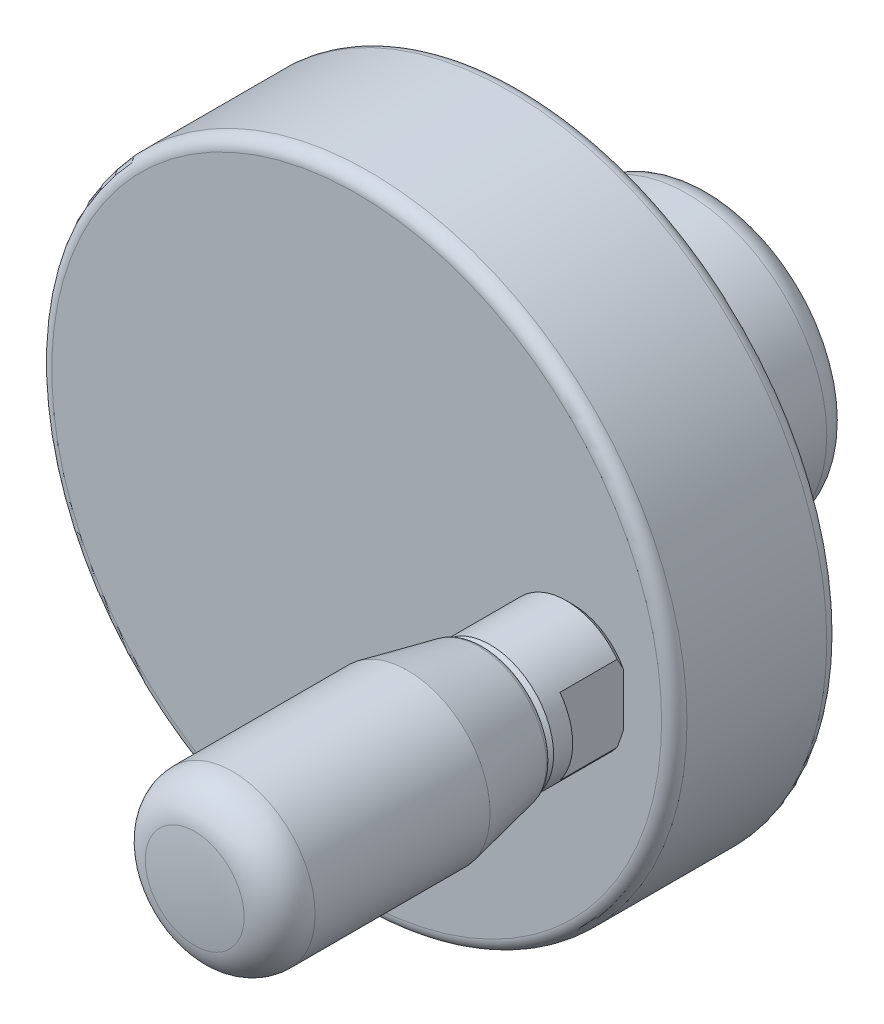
ISO-10303-21;
HEADER;
FILE_DESCRIPTION(('STEP AP214'),'2;1');
FILE_NAME('part.step','',(''),(''),'','','');
FILE_SCHEMA(('AUTOMOTIVE_DESIGN { 1 0 10303 214 1 1 1 1 }'));
ENDSEC;
DATA;
#1=APPLICATION_CONTEXT('core data for automotive mechanical design processes');
#2=APPLICATION_PROTOCOL_DEFINITION('international standard','automotive_design',2000,#1);
#3=PRODUCT_CONTEXT('',#1,'mechanical');
#4=PRODUCT('Part','Part','',(#3));
#5=PRODUCT_RELATED_PRODUCT_CATEGORY('part','',(#4));
#6=PRODUCT_DEFINITION_FORMATION('','',#4);
#7=PRODUCT_DEFINITION_CONTEXT('part definition',#1,'design');
#8=PRODUCT_DEFINITION('design','',#6,#7);
#9=PRODUCT_DEFINITION_SHAPE('','',#8);
#10=(LENGTH_UNIT() NAMED_UNIT(*) SI_UNIT(.MILLI.,.METRE.));
#11=(NAMED_UNIT(*) PLANE_ANGLE_UNIT() SI_UNIT($,.RADIAN.));
#12=(NAMED_UNIT(*) SI_UNIT($,.STERADIAN.) SOLID_ANGLE_UNIT());
#13=UNCERTAINTY_MEASURE_WITH_UNIT(LENGTH_MEASURE(1.E-05),#10,'distance_accuracy_value','');
#14=(GEOMETRIC_REPRESENTATION_CONTEXT(3) GLOBAL_UNCERTAINTY_ASSIGNED_CONTEXT((#13)) GLOBAL_UNIT_ASSIGNED_CONTEXT((#10,
#11,#12)) REPRESENTATION_CONTEXT('',''));
#15=CARTESIAN_POINT('',(0.,0.,0.));
#16=DIRECTION('',(0.,0.,1.));
#17=DIRECTION('',(1.,0.,0.));
#18=AXIS2_PLACEMENT_3D('',#15,#16,#17);
#19=CARTESIAN_POINT('',(0.,5.,18.));
#20=DIRECTION('',(0.,0.,1.));
#21=DIRECTION('',(1.,0.,0.));
#22=AXIS2_PLACEMENT_3D('',#19,#20,#21);
#23=PLANE('',#22);
#24=CARTESIAN_POINT('',(0.,0.,18.));
#25=DIRECTION('',(0.,0.,1.));
#26=DIRECTION('',(1.,0.,0.));
#27=AXIS2_PLACEMENT_3D('',#24,#25,#26);
#28=CIRCLE('',#27,5.);
#29=CARTESIAN_POINT('',(5.,0.,18.));
#30=VERTEX_POINT('',#29);
#31=EDGE_CURVE('E79',#30,#30,#28,.T.);
#32=ORIENTED_EDGE('',*,*,#31,.F.);
#33=EDGE_LOOP('',(#32));
#34=FACE_BOUND('',#33,.T.);
#35=ADVANCED_FACE('F14',(#34),#23,.F.);
#36=CARTESIAN_POINT('',(0.,0.,33.));
#37=DIRECTION('',(0.,0.,1.));
#38=DIRECTION('',(1.,0.,0.));
#39=AXIS2_PLACEMENT_3D('',#36,#37,#38);
#40=CYLINDRICAL_SURFACE('',#39,5.);
#41=CARTESIAN_POINT('',(0.,0.,0.));
#42=DIRECTION('',(0.,0.,1.));
#43=DIRECTION('',(1.,0.,0.));
#44=AXIS2_PLACEMENT_3D('',#41,#42,#43);
#45=CIRCLE('',#44,5.);
#46=CARTESIAN_POINT('',(5.,0.,0.));
#47=VERTEX_POINT('',#46);
#48=EDGE_CURVE('E182',#47,#47,#45,.T.);
#49=ORIENTED_EDGE('',*,*,#48,.F.);
#50=EDGE_LOOP('',(#49));
#51=FACE_BOUND('',#50,.T.);
#52=ORIENTED_EDGE('',*,*,#31,.T.);
#53=EDGE_LOOP('',(#52));
#54=FACE_BOUND('',#53,.T.);
#55=ADVANCED_FACE('F214',(#51,#54),#40,.F.);
#56=CARTESIAN_POINT('',(0.,9.,0.));
#57=DIRECTION('',(0.,0.,1.));
#58=DIRECTION('',(1.,0.,0.));
#59=AXIS2_PLACEMENT_3D('',#56,#57,#58);
#60=PLANE('',#59);
#61=CARTESIAN_POINT('',(0.,0.,0.));
#62=DIRECTION('',(0.,0.,1.));
#63=DIRECTION('',(1.,0.,0.));
#64=AXIS2_PLACEMENT_3D('',#61,#62,#63);
#65=CIRCLE('',#64,9.);
#66=CARTESIAN_POINT('',(9.,0.,0.));
#67=VERTEX_POINT('',#66);
#68=EDGE_CURVE('E179',#67,#67,#65,.T.);
#69=ORIENTED_EDGE('',*,*,#68,.F.);
#70=EDGE_LOOP('',(#69));
#71=FACE_BOUND('',#70,.T.);
#72=ORIENTED_EDGE('',*,*,#48,.T.);
#73=EDGE_LOOP('',(#72));
#74=FACE_BOUND('',#73,.T.);
#75=ADVANCED_FACE('F220',(#71,#74),#60,.F.);
#76=CARTESIAN_POINT('',(0.,0.,2.));
#77=DIRECTION('',(0.,0.,1.));
#78=DIRECTION('',(1.,0.,0.));
#79=AXIS2_PLACEMENT_3D('',#76,#77,#78);
#80=TOROIDAL_SURFACE('',#79,9.,2.);
#81=CARTESIAN_POINT('',(0.,0.,2.));
#82=DIRECTION('',(0.,0.,1.));
#83=DIRECTION('',(1.,0.,0.));
#84=AXIS2_PLACEMENT_3D('',#81,#82,#83);
#85=CIRCLE('',#84,11.);
#86=CARTESIAN_POINT('',(11.,0.,2.));
#87=VERTEX_POINT('',#86);
#88=EDGE_CURVE('E176',#87,#87,#85,.T.);
#89=ORIENTED_EDGE('',*,*,#88,.F.);
#90=EDGE_LOOP('',(#89));
#91=FACE_BOUND('',#90,.T.);
#92=ORIENTED_EDGE('',*,*,#68,.T.);
#93=EDGE_LOOP('',(#92));
#94=FACE_BOUND('',#93,.T.);
#95=ADVANCED_FACE('F228',(#91,#94),#80,.T.);
#96=CARTESIAN_POINT('',(0.,0.,33.));
#97=DIRECTION('',(0.,0.,1.));
#98=DIRECTION('',(1.,0.,0.));
#99=AXIS2_PLACEMENT_3D('',#96,#97,#98);
#100=CYLINDRICAL_SURFACE('',#99,11.);
#101=CARTESIAN_POINT('',(0.,0.,12.));
#102=DIRECTION('',(0.,0.,1.));
#103=DIRECTION('',(1.,0.,0.));
#104=AXIS2_PLACEMENT_3D('',#101,#102,#103);
#105=CIRCLE('',#104,11.);
#106=CARTESIAN_POINT('',(11.,0.,12.));
#107=VERTEX_POINT('',#106);
#108=EDGE_CURVE('E173',#107,#107,#105,.T.);
#109=ORIENTED_EDGE('',*,*,#108,.F.);
#110=EDGE_LOOP('',(#109));
#111=FACE_BOUND('',#110,.T.);
#112=ORIENTED_EDGE('',*,*,#88,.T.);
#113=EDGE_LOOP('',(#112));
#114=FACE_BOUND('',#113,.T.);
#115=ADVANCED_FACE('F235',(#111,#114),#100,.T.);
#116=CARTESIAN_POINT('',(0.,0.,12.));
#117=DIRECTION('',(0.,0.,1.));
#118=DIRECTION('',(1.,0.,0.));
#119=AXIS2_PLACEMENT_3D('',#116,#117,#118);
#120=TOROIDAL_SURFACE('',#119,14.,3.);
#121=CARTESIAN_POINT('',(0.,0.,15.));
#122=DIRECTION('',(0.,0.,1.));
#123=DIRECTION('',(1.,0.,0.));
#124=AXIS2_PLACEMENT_3D('',#121,#122,#123);
#125=CIRCLE('',#124,14.);
#126=CARTESIAN_POINT('',(14.,0.,15.));
#127=VERTEX_POINT('',#126);
#128=EDGE_CURVE('E170',#127,#127,#125,.T.);
#129=ORIENTED_EDGE('',*,*,#128,.F.);
#130=EDGE_LOOP('',(#129));
#131=FACE_BOUND('',#130,.T.);
#132=ORIENTED_EDGE('',*,*,#108,.T.);
#133=EDGE_LOOP('',(#132));
#134=FACE_BOUND('',#133,.T.);
#135=ADVANCED_FACE('F239',(#131,#134),#120,.F.);
#136=CARTESIAN_POINT('',(0.,24.,15.));
#137=DIRECTION('',(0.,0.,1.));
#138=DIRECTION('',(1.,0.,0.));
#139=AXIS2_PLACEMENT_3D('',#136,#137,#138);
#140=PLANE('',#139);
#141=CARTESIAN_POINT('',(0.,0.,15.));
#142=DIRECTION('',(0.,0.,1.));
#143=DIRECTION('',(1.,0.,0.));
#144=AXIS2_PLACEMENT_3D('',#141,#142,#143);
#145=CIRCLE('',#144,24.);
#146=CARTESIAN_POINT('',(24.,0.,15.));
#147=VERTEX_POINT('',#146);
#148=EDGE_CURVE('E167',#147,#147,#145,.T.);
#149=ORIENTED_EDGE('',*,*,#148,.F.);
#150=EDGE_LOOP('',(#149));
#151=FACE_BOUND('',#150,.T.);
#152=ORIENTED_EDGE('',*,*,#128,.T.);
#153=EDGE_LOOP('',(#152));
#154=FACE_BOUND('',#153,.T.);
#155=ADVANCED_FACE('F243',(#151,#154),#140,.F.);
#156=CARTESIAN_POINT('',(0.,0.,16.));
#157=DIRECTION('',(0.,0.,1.));
#158=DIRECTION('',(1.,0.,0.));
#159=AXIS2_PLACEMENT_3D('',#156,#157,#158);
#160=TOROIDAL_SURFACE('',#159,24.,1.00000000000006);
#161=CARTESIAN_POINT('',(0.,0.,16.));
#162=DIRECTION('',(0.,0.,1.));
#163=DIRECTION('',(1.,0.,0.));
#164=AXIS2_PLACEMENT_3D('',#161,#162,#163);
#165=CIRCLE('',#164,25.);
#166=CARTESIAN_POINT('',(25.,0.,16.));
#167=VERTEX_POINT('',#166);
#168=EDGE_CURVE('E162',#167,#167,#165,.T.);
#169=ORIENTED_EDGE('',*,*,#168,.F.);
#170=EDGE_LOOP('',(#169));
#171=FACE_BOUND('',#170,.T.);
#172=ORIENTED_EDGE('',*,*,#148,.T.);
#173=EDGE_LOOP('',(#172));
#174=FACE_BOUND('',#173,.T.);
#175=ADVANCED_FACE('F247',(#171,#174),#160,.T.);
#176=CARTESIAN_POINT('',(0.,0.,33.));
#177=DIRECTION('',(0.,0.,1.));
#178=DIRECTION('',(1.,0.,0.));
#179=AXIS2_PLACEMENT_3D('',#176,#177,#178);
#180=CYLINDRICAL_SURFACE('',#179,25.);
#181=CARTESIAN_POINT('',(0.,0.,27.));
#182=DIRECTION('',(0.,0.,1.));
#183=DIRECTION('',(1.,0.,0.));
#184=AXIS2_PLACEMENT_3D('',#181,#182,#183);
#185=CIRCLE('',#184,25.);
#186=CARTESIAN_POINT('',(25.,0.,27.));
#187=VERTEX_POINT('',#186);
#188=EDGE_CURVE('E158',#187,#187,#185,.T.);
#189=ORIENTED_EDGE('',*,*,#188,.F.);
#190=EDGE_LOOP('',(#189));
#191=FACE_BOUND('',#190,.T.);
#192=ORIENTED_EDGE('',*,*,#168,.T.);
#193=EDGE_LOOP('',(#192));
#194=FACE_BOUND('',#193,.T.);
#195=ADVANCED_FACE('F251',(#191,#194),#180,.T.);
#196=CARTESIAN_POINT('',(0.,0.,27.));
#197=DIRECTION('',(0.,0.,1.));
#198=DIRECTION('',(1.,0.,0.));
#199=AXIS2_PLACEMENT_3D('',#196,#197,#198);
#200=TOROIDAL_SURFACE('',#199,24.,0.999999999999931);
#201=CARTESIAN_POINT('',(0.,0.,28.));
#202=DIRECTION('',(0.,0.,1.));
#203=DIRECTION('',(1.,0.,0.));
#204=AXIS2_PLACEMENT_3D('',#201,#202,#203);
#205=CIRCLE('',#204,24.);
#206=CARTESIAN_POINT('',(24.,0.,28.));
#207=VERTEX_POINT('',#206);
#208=EDGE_CURVE('E156',#207,#207,#205,.T.);
#209=ORIENTED_EDGE('',*,*,#208,.F.);
#210=EDGE_LOOP('',(#209));
#211=FACE_BOUND('',#210,.T.);
#212=ORIENTED_EDGE('',*,*,#188,.T.);
#213=EDGE_LOOP('',(#212));
#214=FACE_BOUND('',#213,.T.);
#215=ADVANCED_FACE('F255',(#211,#214),#200,.T.);
#216=CARTESIAN_POINT('',(0.,24.,28.));
#217=DIRECTION('',(0.,0.,-1.));
#218=DIRECTION('',(-1.,0.,0.));
#219=AXIS2_PLACEMENT_3D('',#216,#217,#218);
#220=PLANE('',#219);
#221=CARTESIAN_POINT('',(17.,0.,28.));
#222=DIRECTION('',(0.,0.,-1.));
#223=DIRECTION('',(0.,1.,0.));
#224=AXIS2_PLACEMENT_3D('',#221,#222,#223);
#225=CIRCLE('',#224,4.5);
#226=CARTESIAN_POINT('',(21.,2.06155281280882,28.));
#227=VERTEX_POINT('',#226);
#228=CARTESIAN_POINT('',(13.,2.06155281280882,28.));
#229=VERTEX_POINT('',#228);
#230=EDGE_CURVE('E24',#227,#229,#225,.F.);
#231=ORIENTED_EDGE('',*,*,#230,.F.);
#232=DIRECTION('',(0.,-1.,0.));
#233=VECTOR('',#232,1.);
#234=CARTESIAN_POINT('',(21.,24.,28.));
#235=LINE('',#234,#233);
#236=CARTESIAN_POINT('',(21.,-2.06155281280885,28.));
#237=VERTEX_POINT('',#236);
#238=EDGE_CURVE('E9',#227,#237,#235,.T.);
#239=ORIENTED_EDGE('',*,*,#238,.T.);
#240=CARTESIAN_POINT('',(17.,0.,28.));
#241=DIRECTION('',(0.,0.,-1.));
#242=DIRECTION('',(0.,1.,0.));
#243=AXIS2_PLACEMENT_3D('',#240,#241,#242);
#244=CIRCLE('',#243,4.5);
#245=CARTESIAN_POINT('',(13.,-2.06155281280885,28.));
#246=VERTEX_POINT('',#245);
#247=EDGE_CURVE('E71',#246,#237,#244,.F.);
#248=ORIENTED_EDGE('',*,*,#247,.F.);
#249=DIRECTION('',(0.,1.,0.));
#250=VECTOR('',#249,1.);
#251=CARTESIAN_POINT('',(13.,24.,28.));
#252=LINE('',#251,#250);
#253=EDGE_CURVE('E73',#246,#229,#252,.T.);
#254=ORIENTED_EDGE('',*,*,#253,.T.);
#255=EDGE_LOOP('',(#231,#239,#248,#254));
#256=FACE_BOUND('',#255,.T.);
#257=ORIENTED_EDGE('',*,*,#208,.T.);
#258=EDGE_LOOP('',(#257));
#259=FACE_BOUND('',#258,.T.);
#260=ADVANCED_FACE('F74',(#256,#259),#220,.F.);
#261=CARTESIAN_POINT('',(17.,0.,28.));
#262=DIRECTION('',(0.,0.,1.));
#263=DIRECTION('',(0.,1.,0.));
#264=AXIS2_PLACEMENT_3D('',#261,#262,#263);
#265=SPHERICAL_SURFACE('',#264,30.);
#266=CARTESIAN_POINT('',(17.,0.,57.7468745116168));
#267=DIRECTION('',(0.,0.,1.));
#268=DIRECTION('',(1.,0.,0.));
#269=AXIS2_PLACEMENT_3D('',#266,#267,#268);
#270=CIRCLE('',#269,3.88888888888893);
#271=CARTESIAN_POINT('',(20.8888888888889,0.,57.7468745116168));
#272=VERTEX_POINT('',#271);
#273=EDGE_CURVE('E129',#272,#272,#270,.T.);
#274=ORIENTED_EDGE('',*,*,#273,.T.);
#275=EDGE_LOOP('',(#274));
#276=FACE_BOUND('',#275,.T.);
#277=ADVANCED_FACE('F16',(#276),#265,.T.);
#278=CARTESIAN_POINT('',(17.,0.,54.7721870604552));
#279=DIRECTION('',(0.,0.,1.));
#280=DIRECTION('',(1.,0.,0.));
#281=AXIS2_PLACEMENT_3D('',#278,#279,#280);
#282=TOROIDAL_SURFACE('',#281,3.5,3.);
#283=ORIENTED_EDGE('',*,*,#273,.F.);
#284=EDGE_LOOP('',(#283));
#285=FACE_BOUND('',#284,.T.);
#286=CARTESIAN_POINT('',(17.,0.,54.7721870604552));
#287=DIRECTION('',(0.,0.,1.));
#288=DIRECTION('',(1.,0.,0.));
#289=AXIS2_PLACEMENT_3D('',#286,#287,#288);
#290=CIRCLE('',#289,6.5);
#291=CARTESIAN_POINT('',(23.5,0.,54.7721870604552));
#292=VERTEX_POINT('',#291);
#293=EDGE_CURVE('E132',#292,#292,#290,.T.);
#294=ORIENTED_EDGE('',*,*,#293,.T.);
#295=EDGE_LOOP('',(#294));
#296=FACE_BOUND('',#295,.T.);
#297=ADVANCED_FACE('F201',(#285,#296),#282,.T.);
#298=CARTESIAN_POINT('',(17.,0.,60.5));
#299=DIRECTION('',(0.,0.,1.));
#300=DIRECTION('',(1.,0.,0.));
#301=AXIS2_PLACEMENT_3D('',#298,#299,#300);
#302=CYLINDRICAL_SURFACE('',#301,6.5);
#303=ORIENTED_EDGE('',*,*,#293,.F.);
#304=EDGE_LOOP('',(#303));
#305=FACE_BOUND('',#304,.T.);
#306=CARTESIAN_POINT('',(17.,0.,41.));
#307=DIRECTION('',(0.,0.,1.));
#308=DIRECTION('',(1.,0.,0.));
#309=AXIS2_PLACEMENT_3D('',#306,#307,#308);
#310=CIRCLE('',#309,6.5);
#311=CARTESIAN_POINT('',(23.5,0.,41.));
#312=VERTEX_POINT('',#311);
#313=EDGE_CURVE('E135',#312,#312,#310,.T.);
#314=ORIENTED_EDGE('',*,*,#313,.T.);
#315=EDGE_LOOP('',(#314));
#316=FACE_BOUND('',#315,.T.);
#317=ADVANCED_FACE('F211',(#305,#316),#302,.T.);
#318=CARTESIAN_POINT('',(17.,0.,35.398022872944));
#319=DIRECTION('',(0.,0.,1.));
#320=DIRECTION('',(1.,0.,0.));
#321=AXIS2_PLACEMENT_3D('',#318,#319,#320);
#322=CONICAL_SURFACE('',#321,5.33292143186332,0.20539538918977);
#323=ORIENTED_EDGE('',*,*,#313,.F.);
#324=EDGE_LOOP('',(#323));
#325=FACE_BOUND('',#324,.T.);
#326=CARTESIAN_POINT('',(17.,0.,35.398022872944));
#327=DIRECTION('',(0.,0.,1.));
#328=DIRECTION('',(1.,0.,0.));
#329=AXIS2_PLACEMENT_3D('',#326,#327,#328);
#330=CIRCLE('',#329,5.33292143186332);
#331=CARTESIAN_POINT('',(22.3329214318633,0.,35.398022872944));
#332=VERTEX_POINT('',#331);
#333=EDGE_CURVE('E138',#332,#332,#330,.T.);
#334=ORIENTED_EDGE('',*,*,#333,.T.);
#335=EDGE_LOOP('',(#334));
#336=FACE_BOUND('',#335,.T.);
#337=ADVANCED_FACE('F283',(#325,#336),#322,.T.);
#338=CARTESIAN_POINT('',(17.,0.,35.5));
#339=DIRECTION('',(0.,0.,1.));
#340=DIRECTION('',(1.,0.,0.));
#341=AXIS2_PLACEMENT_3D('',#338,#339,#340);
#342=TOROIDAL_SURFACE('',#341,4.84343122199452,0.500000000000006);
#343=ORIENTED_EDGE('',*,*,#333,.F.);
#344=EDGE_LOOP('',(#343));
#345=FACE_BOUND('',#344,.T.);
#346=CARTESIAN_POINT('',(17.,0.,35.));
#347=DIRECTION('',(0.,0.,1.));
#348=DIRECTION('',(1.,0.,0.));
#349=AXIS2_PLACEMENT_3D('',#346,#347,#348);
#350=CIRCLE('',#349,4.84343122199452);
#351=CARTESIAN_POINT('',(21.8434312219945,0.,35.));
#352=VERTEX_POINT('',#351);
#353=EDGE_CURVE('E141',#352,#352,#350,.T.);
#354=ORIENTED_EDGE('',*,*,#353,.T.);
#355=EDGE_LOOP('',(#354));
#356=FACE_BOUND('',#355,.T.);
#357=ADVANCED_FACE('F279',(#345,#356),#342,.T.);
#358=CARTESIAN_POINT('',(17.,4.84343122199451,35.));
#359=DIRECTION('',(0.,0.,1.));
#360=DIRECTION('',(1.,0.,0.));
#361=AXIS2_PLACEMENT_3D('',#358,#359,#360);
#362=PLANE('',#361);
#363=ORIENTED_EDGE('',*,*,#353,.F.);
#364=EDGE_LOOP('',(#363));
#365=FACE_BOUND('',#364,.T.);
#366=CARTESIAN_POINT('',(17.,0.,35.));
#367=DIRECTION('',(0.,0.,1.));
#368=DIRECTION('',(1.,0.,0.));
#369=AXIS2_PLACEMENT_3D('',#366,#367,#368);
#370=CIRCLE('',#369,4.49999999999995);
#371=CARTESIAN_POINT('',(21.5,0.,35.));
#372=VERTEX_POINT('',#371);
#373=EDGE_CURVE('E144',#372,#372,#370,.T.);
#374=ORIENTED_EDGE('',*,*,#373,.T.);
#375=EDGE_LOOP('',(#374));
#376=FACE_BOUND('',#375,.T.);
#377=ADVANCED_FACE('F207',(#365,#376),#362,.F.);
#378=CARTESIAN_POINT('',(17.,0.,34.5));
#379=DIRECTION('',(0.,0.,-1.));
#380=DIRECTION('',(-1.,0.,0.));
#381=AXIS2_PLACEMENT_3D('',#378,#379,#380);
#382=CONICAL_SURFACE('',#381,5.,0.785398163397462);
#383=ORIENTED_EDGE('',*,*,#373,.F.);
#384=EDGE_LOOP('',(#383));
#385=FACE_BOUND('',#384,.T.);
#386=CARTESIAN_POINT('',(17.,0.,34.5));
#387=DIRECTION('',(0.,0.,1.));
#388=DIRECTION('',(1.,0.,0.));
#389=AXIS2_PLACEMENT_3D('',#386,#387,#388);
#390=CIRCLE('',#389,5.);
#391=CARTESIAN_POINT('',(22.,0.,34.5));
#392=VERTEX_POINT('',#391);
#393=EDGE_CURVE('E147',#392,#392,#390,.T.);
#394=ORIENTED_EDGE('',*,*,#393,.T.);
#395=EDGE_LOOP('',(#394));
#396=FACE_BOUND('',#395,.T.);
#397=ADVANCED_FACE('F200',(#385,#396),#382,.T.);
#398=CARTESIAN_POINT('',(21.,3.,33.));
#399=DIRECTION('',(0.,0.,1.));
#400=DIRECTION('',(1.,0.,0.));
#401=AXIS2_PLACEMENT_3D('',#398,#399,#400);
#402=PLANE('',#401);
#403=CARTESIAN_POINT('',(17.,0.,33.));
#404=DIRECTION('',(0.,0.,1.));
#405=DIRECTION('',(1.,0.,0.));
#406=AXIS2_PLACEMENT_3D('',#403,#404,#405);
#407=CIRCLE('',#406,5.);
#408=CARTESIAN_POINT('',(21.,-3.,33.));
#409=VERTEX_POINT('',#408);
#410=CARTESIAN_POINT('',(21.,3.,33.));
#411=VERTEX_POINT('',#410);
#412=EDGE_CURVE('E153',#409,#411,#407,.T.);
#413=ORIENTED_EDGE('',*,*,#412,.F.);
#414=DIRECTION('',(0.,-1.,0.));
#415=VECTOR('',#414,1.);
#416=CARTESIAN_POINT('',(21.,3.,33.));
#417=LINE('',#416,#415);
#418=EDGE_CURVE('E61',#411,#409,#417,.T.);
#419=ORIENTED_EDGE('',*,*,#418,.F.);
#420=EDGE_LOOP('',(#413,#419));
#421=FACE_BOUND('',#420,.T.);
#422=ADVANCED_FACE('F117',(#421),#402,.F.);
#423=CARTESIAN_POINT('',(13.,3.,33.));
#424=DIRECTION('',(0.,0.,-1.));
#425=DIRECTION('',(-1.,0.,0.));
#426=AXIS2_PLACEMENT_3D('',#423,#424,#425);
#427=PLANE('',#426);
#428=CARTESIAN_POINT('',(17.,0.,33.));
#429=DIRECTION('',(0.,0.,-1.));
#430=DIRECTION('',(-1.,0.,0.));
#431=AXIS2_PLACEMENT_3D('',#428,#429,#430);
#432=CIRCLE('',#431,5.);
#433=CARTESIAN_POINT('',(13.,-3.,33.));
#434=VERTEX_POINT('',#433);
#435=CARTESIAN_POINT('',(13.,2.99999999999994,33.));
#436=VERTEX_POINT('',#435);
#437=EDGE_CURVE('E67',#434,#436,#432,.T.);
#438=ORIENTED_EDGE('',*,*,#437,.T.);
#439=DIRECTION('',(0.,-1.,0.));
#440=VECTOR('',#439,1.);
#441=CARTESIAN_POINT('',(13.,3.,33.));
#442=LINE('',#441,#440);
#443=EDGE_CURVE('E187',#436,#434,#442,.T.);
#444=ORIENTED_EDGE('',*,*,#443,.T.);
#445=EDGE_LOOP('',(#438,#444));
#446=FACE_BOUND('',#445,.T.);
#447=ADVANCED_FACE('F112',(#446),#427,.T.);
#448=CARTESIAN_POINT('',(17.,0.,60.5));
#449=DIRECTION('',(0.,0.,1.));
#450=DIRECTION('',(1.,0.,0.));
#451=AXIS2_PLACEMENT_3D('',#448,#449,#450);
#452=CYLINDRICAL_SURFACE('',#451,5.);
#453=ORIENTED_EDGE('',*,*,#393,.F.);
#454=EDGE_LOOP('',(#453));
#455=FACE_BOUND('',#454,.T.);
#456=DIRECTION('',(0.,0.,1.));
#457=VECTOR('',#456,1.);
#458=CARTESIAN_POINT('',(13.,2.99999999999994,60.5));
#459=LINE('',#458,#457);
#460=CARTESIAN_POINT('',(13.,3.,28.5));
#461=VERTEX_POINT('',#460);
#462=EDGE_CURVE('E18',#436,#461,#459,.F.);
#463=ORIENTED_EDGE('',*,*,#462,.F.);
#464=ORIENTED_EDGE('',*,*,#437,.F.);
#465=DIRECTION('',(0.,0.,-1.));
#466=VECTOR('',#465,1.);
#467=CARTESIAN_POINT('',(13.,-3.,28.));
#468=LINE('',#467,#466);
#469=CARTESIAN_POINT('',(13.,-3.,28.5));
#470=VERTEX_POINT('',#469);
#471=EDGE_CURVE('E96',#434,#470,#468,.T.);
#472=ORIENTED_EDGE('',*,*,#471,.T.);
#473=CARTESIAN_POINT('',(17.,0.,28.5));
#474=DIRECTION('',(0.,0.,1.));
#475=DIRECTION('',(1.,0.,0.));
#476=AXIS2_PLACEMENT_3D('',#473,#474,#475);
#477=CIRCLE('',#476,5.);
#478=CARTESIAN_POINT('',(21.,-3.,28.5));
#479=VERTEX_POINT('',#478);
#480=EDGE_CURVE('E150',#470,#479,#477,.T.);
#481=ORIENTED_EDGE('',*,*,#480,.T.);
#482=DIRECTION('',(0.,0.,-1.));
#483=VECTOR('',#482,1.);
#484=CARTESIAN_POINT('',(21.,-3.,33.));
#485=LINE('',#484,#483);
#486=EDGE_CURVE('E94',#409,#479,#485,.T.);
#487=ORIENTED_EDGE('',*,*,#486,.F.);
#488=ORIENTED_EDGE('',*,*,#412,.T.);
#489=DIRECTION('',(0.,0.,1.));
#490=VECTOR('',#489,1.);
#491=CARTESIAN_POINT('',(21.,2.99999999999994,60.5));
#492=LINE('',#491,#490);
#493=CARTESIAN_POINT('',(21.,3.,28.5));
#494=VERTEX_POINT('',#493);
#495=EDGE_CURVE('E155',#494,#411,#492,.T.);
#496=ORIENTED_EDGE('',*,*,#495,.F.);
#497=EDGE_CURVE('E151',#494,#461,#477,.T.);
#498=ORIENTED_EDGE('',*,*,#497,.T.);
#499=EDGE_LOOP('',(#463,#464,#472,#481,#487,#488,#496,#498));
#500=FACE_BOUND('',#499,.T.);
#501=ADVANCED_FACE('F116',(#455,#500),#452,.T.);
#502=CARTESIAN_POINT('',(17.,0.,28.));
#503=DIRECTION('',(0.,0.,1.));
#504=DIRECTION('',(1.,0.,0.));
#505=AXIS2_PLACEMENT_3D('',#502,#503,#504);
#506=CONICAL_SURFACE('',#505,4.5,0.785398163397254);
#507=CARTESIAN_POINT('',(13.,6.61267837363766,31.2283578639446));
#508=CARTESIAN_POINT('',(13.,6.5138484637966,31.1437976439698));
#509=CARTESIAN_POINT('',(13.,6.41477027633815,31.0595275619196));
#510=CARTESIAN_POINT('',(13.,6.21605204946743,30.8916487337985));
#511=CARTESIAN_POINT('',(13.,6.11641199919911,30.8080400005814));
#512=CARTESIAN_POINT('',(13.,5.81645670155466,30.5582489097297));
#513=CARTESIAN_POINT('',(13.,5.61520522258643,30.3931865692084));
#514=CARTESIAN_POINT('',(13.,5.20414443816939,30.0626045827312));
#515=CARTESIAN_POINT('',(13.,4.99425007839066,29.8971902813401));
#516=CARTESIAN_POINT('',(13.,4.57024237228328,29.5719522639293));
#517=CARTESIAN_POINT('',(13.,4.35613010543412,29.4121271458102));
#518=CARTESIAN_POINT('',(13.,3.92191769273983,29.0998698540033));
#519=CARTESIAN_POINT('',(13.,3.70180729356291,28.9474517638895));
#520=CARTESIAN_POINT('',(13.,3.3660226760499,28.7271432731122));
#521=CARTESIAN_POINT('',(13.,3.25310127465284,28.655060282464));
#522=CARTESIAN_POINT('',(13.,3.02514651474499,28.514324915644));
#523=CARTESIAN_POINT('',(13.,2.91011332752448,28.4456722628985));
#524=CARTESIAN_POINT('',(13.,2.67874926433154,28.3131895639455));
#525=CARTESIAN_POINT('',(13.,2.56244159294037,28.2493194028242));
#526=CARTESIAN_POINT('',(13.,2.32719948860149,28.1266386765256));
#527=CARTESIAN_POINT('',(13.,2.2082647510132,28.0678287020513));
#528=CARTESIAN_POINT('',(13.,1.847452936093,27.9008663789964));
#529=CARTESIAN_POINT('',(13.,1.60104963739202,27.8018732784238));
#530=CARTESIAN_POINT('',(13.,1.21869368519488,27.6797214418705));
#531=CARTESIAN_POINT('',(13.,1.08703991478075,27.6430541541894));
#532=CARTESIAN_POINT('',(13.,0.820997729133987,27.5813368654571));
#533=CARTESIAN_POINT('',(13.,0.686609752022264,27.556285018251));
#534=CARTESIAN_POINT('',(13.,0.416637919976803,27.5194288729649));
#535=CARTESIAN_POINT('',(13.,0.281062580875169,27.5075632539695));
#536=CARTESIAN_POINT('',(13.,0.00940161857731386,27.4977080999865));
#537=CARTESIAN_POINT('',(13.,-0.126683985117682,27.4997180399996));
#538=CARTESIAN_POINT('',(13.,-0.397695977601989,27.5174494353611));
#539=CARTESIAN_POINT('',(13.,-0.532623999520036,27.5331464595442));
#540=CARTESIAN_POINT('',(13.,-0.80039046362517,27.5771511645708));
#541=CARTESIAN_POINT('',(13.,-0.933228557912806,27.6054609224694));
#542=CARTESIAN_POINT('',(13.,-1.19683850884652,27.6732578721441));
#543=CARTESIAN_POINT('',(13.,-1.32759286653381,27.712812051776));
#544=CARTESIAN_POINT('',(13.,-1.58587707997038,27.8011944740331));
#545=CARTESIAN_POINT('',(13.,-1.71340705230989,27.8500223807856));
#546=CARTESIAN_POINT('',(13.,-2.00607339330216,27.9722871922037));
#547=CARTESIAN_POINT('',(13.,-2.17001221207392,28.0485725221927));
#548=CARTESIAN_POINT('',(13.,-2.49288824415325,28.2111596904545));
#549=CARTESIAN_POINT('',(13.,-2.65182228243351,28.2974677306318));
#550=CARTESIAN_POINT('',(13.,-2.96566951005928,28.4778181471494));
#551=CARTESIAN_POINT('',(13.,-3.12057308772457,28.5718771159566));
#552=CARTESIAN_POINT('',(13.,-3.42666836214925,28.7657420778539));
#553=CARTESIAN_POINT('',(13.,-3.57786085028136,28.8655468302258));
#554=CARTESIAN_POINT('',(13.,-3.87789023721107,29.0700932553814));
#555=CARTESIAN_POINT('',(13.,-4.02671282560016,29.1748558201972));
#556=CARTESIAN_POINT('',(13.,-4.32180408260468,29.3879178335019));
#557=CARTESIAN_POINT('',(13.,-4.46807264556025,29.496217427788));
#558=CARTESIAN_POINT('',(13.,-4.75830471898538,29.7154998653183));
#559=CARTESIAN_POINT('',(13.,-4.90227076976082,29.8264793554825));
#560=CARTESIAN_POINT('',(13.,-5.18842229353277,30.050713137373));
#561=CARTESIAN_POINT('',(13.,-5.33060772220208,30.1639674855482));
#562=CARTESIAN_POINT('',(13.,-5.66527129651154,30.4341347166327));
#563=CARTESIAN_POINT('',(13.,-5.85710121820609,30.5918491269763));
#564=CARTESIAN_POINT('',(13.,-6.23712174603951,30.9088482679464));
#565=CARTESIAN_POINT('',(13.,-6.42532862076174,31.0681134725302));
#566=CARTESIAN_POINT('',(13.,-6.61267837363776,31.2283578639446));
#567=B_SPLINE_CURVE_WITH_KNOTS('',3,(#507,#508,#509,#510,#511,#512,#513,#514,#515,#516,#517,
#518,#519,#520,#521,#522,#523,#524,#525,#526,#527,#528,#529,#530,#531,#532,#533,#534,#535,#536,
#537,#538,#539,#540,#541,#542,#543,#544,#545,#546,#547,#548,#549,#550,#551,#552,#553,#554,#555,
#556,#557,#558,#559,#560,#561,#562,#563,#564,#565,#566),.UNSPECIFIED.,.F.,.F.,(4,2,2,2,2,2,2,2,
2,2,2,2,2,2,2,2,2,2,2,2,2,2,2,2,2,2,2,2,2,4),(0.,0.390204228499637,0.780416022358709,
1.56123065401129,2.36288213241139,3.16433104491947,3.96724854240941,4.36910117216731,
4.77092134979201,5.16886742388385,5.56685988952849,6.36104037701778,6.77061720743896,
7.18012891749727,7.58772816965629,7.99531199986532,8.40216978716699,8.80909460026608,
9.21849635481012,9.62788328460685,10.1698609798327,10.7121758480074,11.2556834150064,
11.7990740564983,12.3450041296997,12.8909567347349,13.4362584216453,13.9815736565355,
14.7265631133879,15.4661801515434),.UNSPECIFIED.);
#568=EDGE_CURVE('E92',#246,#470,#567,.T.);
#569=ORIENTED_EDGE('',*,*,#568,.F.);
#570=ORIENTED_EDGE('',*,*,#247,.T.);
#571=CARTESIAN_POINT('',(21.,-6.61267837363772,31.2283578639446));
#572=CARTESIAN_POINT('',(21.,-6.51384846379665,31.1437976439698));
#573=CARTESIAN_POINT('',(21.,-6.4147702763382,31.0595275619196));
#574=CARTESIAN_POINT('',(21.,-6.21605204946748,30.8916487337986));
#575=CARTESIAN_POINT('',(21.,-6.11641199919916,30.8080400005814));
#576=CARTESIAN_POINT('',(21.,-5.81645670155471,30.5582489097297));
#577=CARTESIAN_POINT('',(21.,-5.61520522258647,30.3931865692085));
#578=CARTESIAN_POINT('',(21.,-5.20414443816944,30.0626045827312));
#579=CARTESIAN_POINT('',(21.,-4.99425007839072,29.8971902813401));
#580=CARTESIAN_POINT('',(21.,-4.57024237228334,29.5719522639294));
#581=CARTESIAN_POINT('',(21.,-4.35613010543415,29.4121271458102));
#582=CARTESIAN_POINT('',(21.,-3.92191769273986,29.0998698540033));
#583=CARTESIAN_POINT('',(21.,-3.70180729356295,28.9474517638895));
#584=CARTESIAN_POINT('',(21.,-3.36602267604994,28.7271432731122));
#585=CARTESIAN_POINT('',(21.,-3.25310127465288,28.655060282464));
#586=CARTESIAN_POINT('',(21.,-3.02514651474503,28.514324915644));
#587=CARTESIAN_POINT('',(21.,-2.91011332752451,28.4456722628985));
#588=CARTESIAN_POINT('',(21.,-2.67874926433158,28.3131895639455));
#589=CARTESIAN_POINT('',(21.,-2.5624415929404,28.2493194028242));
#590=CARTESIAN_POINT('',(21.,-2.32719948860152,28.1266386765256));
#591=CARTESIAN_POINT('',(21.,-2.20826475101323,28.0678287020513));
#592=CARTESIAN_POINT('',(21.,-1.84745293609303,27.9008663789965));
#593=CARTESIAN_POINT('',(21.,-1.60104963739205,27.8018732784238));
#594=CARTESIAN_POINT('',(21.,-1.2186936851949,27.6797214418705));
#595=CARTESIAN_POINT('',(21.,-1.08703991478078,27.6430541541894));
#596=CARTESIAN_POINT('',(21.,-0.820997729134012,27.5813368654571));
#597=CARTESIAN_POINT('',(21.,-0.686609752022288,27.556285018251));
#598=CARTESIAN_POINT('',(21.,-0.416637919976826,27.5194288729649));
#599=CARTESIAN_POINT('',(21.,-0.281062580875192,27.5075632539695));
#600=CARTESIAN_POINT('',(21.,-0.00940161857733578,27.4977080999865));
#601=CARTESIAN_POINT('',(21.,0.126683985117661,27.4997180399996));
#602=CARTESIAN_POINT('',(21.,0.397695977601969,27.5174494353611));
#603=CARTESIAN_POINT('',(21.,0.532623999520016,27.5331464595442));
#604=CARTESIAN_POINT('',(21.,0.800390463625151,27.5771511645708));
#605=CARTESIAN_POINT('',(21.,0.933228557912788,27.6054609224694));
#606=CARTESIAN_POINT('',(21.,1.19683850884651,27.6732578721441));
#607=CARTESIAN_POINT('',(21.,1.32759286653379,27.7128120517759));
#608=CARTESIAN_POINT('',(21.,1.58587707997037,27.8011944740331));
#609=CARTESIAN_POINT('',(21.,1.71340705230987,27.8500223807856));
#610=CARTESIAN_POINT('',(21.,2.00607339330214,27.9722871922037));
#611=CARTESIAN_POINT('',(21.,2.1700122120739,28.0485725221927));
#612=CARTESIAN_POINT('',(21.,2.49288824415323,28.2111596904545));
#613=CARTESIAN_POINT('',(21.,2.6518222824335,28.2974677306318));
#614=CARTESIAN_POINT('',(21.,2.96566951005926,28.4778181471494));
#615=CARTESIAN_POINT('',(21.,3.12057308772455,28.5718771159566));
#616=CARTESIAN_POINT('',(21.,3.42666836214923,28.7657420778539));
#617=CARTESIAN_POINT('',(21.,3.57786085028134,28.8655468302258));
#618=CARTESIAN_POINT('',(21.,3.87789023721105,29.0700932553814));
#619=CARTESIAN_POINT('',(21.,4.02671282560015,29.1748558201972));
#620=CARTESIAN_POINT('',(21.,4.32180408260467,29.3879178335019));
#621=CARTESIAN_POINT('',(21.,4.46807264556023,29.496217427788));
#622=CARTESIAN_POINT('',(21.,4.75830471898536,29.7154998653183));
#623=CARTESIAN_POINT('',(21.,4.90227076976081,29.8264793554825));
#624=CARTESIAN_POINT('',(21.,5.18842229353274,30.050713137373));
#625=CARTESIAN_POINT('',(21.,5.33060772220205,30.1639674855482));
#626=CARTESIAN_POINT('',(21.,5.6652712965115,30.4341347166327));
#627=CARTESIAN_POINT('',(21.,5.85710121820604,30.5918491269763));
#628=CARTESIAN_POINT('',(21.,6.23712174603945,30.9088482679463));
#629=CARTESIAN_POINT('',(21.,6.42532862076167,31.0681134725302));
#630=CARTESIAN_POINT('',(21.,6.61267837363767,31.2283578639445));
#631=B_SPLINE_CURVE_WITH_KNOTS('',3,(#571,#572,#573,#574,#575,#576,#577,#578,#579,#580,#581,
#582,#583,#584,#585,#586,#587,#588,#589,#590,#591,#592,#593,#594,#595,#596,#597,#598,#599,#600,
#601,#602,#603,#604,#605,#606,#607,#608,#609,#610,#611,#612,#613,#614,#615,#616,#617,#618,#619,
#620,#621,#622,#623,#624,#625,#626,#627,#628,#629,#630),.UNSPECIFIED.,.F.,.F.,(4,2,2,2,2,2,2,2,
2,2,2,2,2,2,2,2,2,2,2,2,2,2,2,2,2,2,2,2,2,4),(0.,0.390204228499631,0.780416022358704,
1.56123065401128,2.36288213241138,3.16433104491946,3.96724854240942,4.36910117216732,
4.77092134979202,5.16886742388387,5.5668598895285,6.3610403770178,6.77061720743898,
7.18012891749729,7.58772816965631,7.99531199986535,8.40216978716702,8.80909460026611,
9.21849635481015,9.62788328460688,10.1698609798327,10.7121758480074,11.2556834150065,
11.7990740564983,12.3450041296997,12.8909567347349,13.4362584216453,13.9815736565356,
14.7265631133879,15.4661801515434),.UNSPECIFIED.);
#632=EDGE_CURVE('E128',#479,#237,#631,.T.);
#633=ORIENTED_EDGE('',*,*,#632,.F.);
#634=ORIENTED_EDGE('',*,*,#480,.F.);
#635=EDGE_LOOP('',(#569,#570,#633,#634));
#636=FACE_BOUND('',#635,.T.);
#637=ADVANCED_FACE('F195',(#636),#506,.T.);
#638=EDGE_CURVE('E86',#461,#229,#567,.T.);
#639=ORIENTED_EDGE('',*,*,#638,.F.);
#640=ORIENTED_EDGE('',*,*,#497,.F.);
#641=EDGE_CURVE('E88',#227,#494,#631,.T.);
#642=ORIENTED_EDGE('',*,*,#641,.F.);
#643=ORIENTED_EDGE('',*,*,#230,.T.);
#644=EDGE_LOOP('',(#639,#640,#642,#643));
#645=FACE_BOUND('',#644,.T.);
#646=ADVANCED_FACE('F84',(#645),#506,.T.);
#647=CARTESIAN_POINT('',(13.,3.,28.));
#648=DIRECTION('',(-1.,0.,0.));
#649=DIRECTION('',(0.,0.,1.));
#650=AXIS2_PLACEMENT_3D('',#647,#648,#649);
#651=PLANE('',#650);
#652=ORIENTED_EDGE('',*,*,#638,.T.);
#653=ORIENTED_EDGE('',*,*,#253,.F.);
#654=ORIENTED_EDGE('',*,*,#568,.T.);
#655=ORIENTED_EDGE('',*,*,#471,.F.);
#656=ORIENTED_EDGE('',*,*,#443,.F.);
#657=ORIENTED_EDGE('',*,*,#462,.T.);
#658=EDGE_LOOP('',(#652,#653,#654,#655,#656,#657));
#659=FACE_BOUND('',#658,.T.);
#660=ADVANCED_FACE('F90',(#659),#651,.T.);
#661=CARTESIAN_POINT('',(21.,-3.,33.));
#662=DIRECTION('',(1.,0.,0.));
#663=DIRECTION('',(0.,0.,-1.));
#664=AXIS2_PLACEMENT_3D('',#661,#662,#663);
#665=PLANE('',#664);
#666=ORIENTED_EDGE('',*,*,#632,.T.);
#667=ORIENTED_EDGE('',*,*,#238,.F.);
#668=ORIENTED_EDGE('',*,*,#641,.T.);
#669=ORIENTED_EDGE('',*,*,#495,.T.);
#670=ORIENTED_EDGE('',*,*,#418,.T.);
#671=ORIENTED_EDGE('',*,*,#486,.T.);
#672=EDGE_LOOP('',(#666,#667,#668,#669,#670,#671));
#673=FACE_BOUND('',#672,.T.);
#674=ADVANCED_FACE('F111',(#673),#665,.T.);
#675=CLOSED_SHELL('',(#35,#55,#75,#95,#115,#135,#155,#175,#195,#215,#260,#277,#297,#317,#337,
#357,#377,#397,#422,#447,#501,#637,#646,#660,#674));
#676=MANIFOLD_SOLID_BREP('B1',#675);
#677=ADVANCED_BREP_SHAPE_REPRESENTATION('',(#18,#676),#14);
#678=SHAPE_DEFINITION_REPRESENTATION(#9,#677);
ENDSEC;
END-ISO-10303-21;
